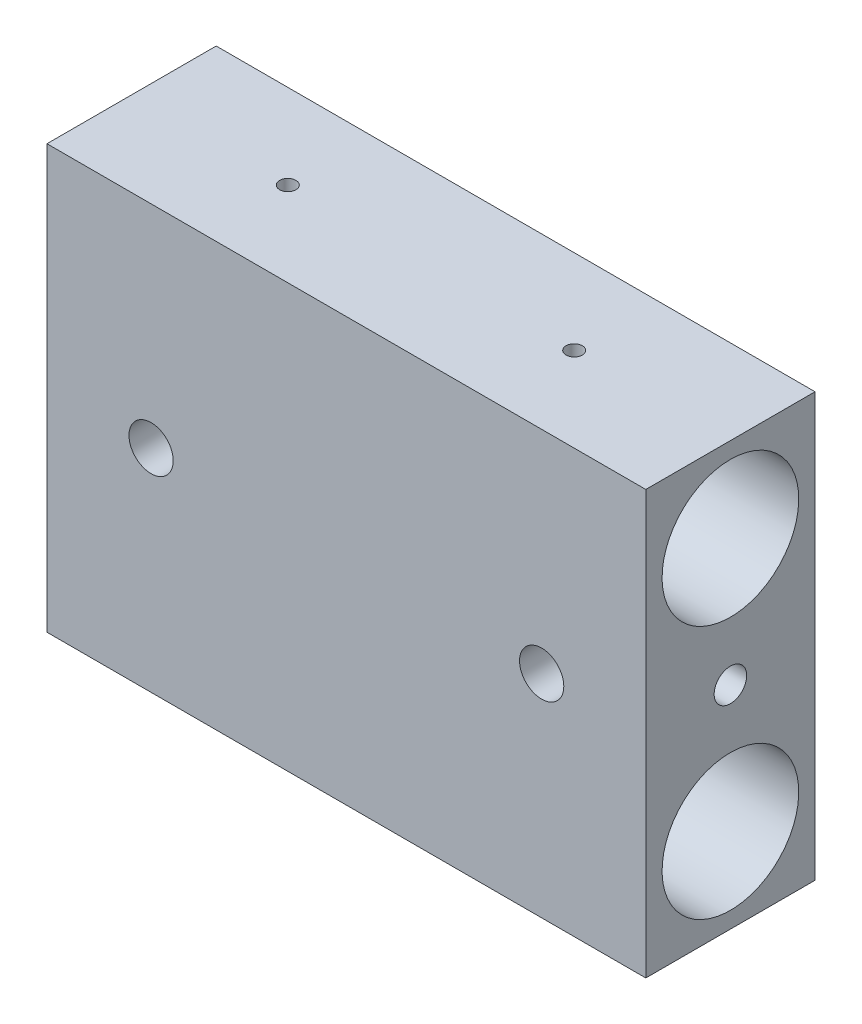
ISO-10303-21;
HEADER;
FILE_DESCRIPTION(('STEP AP214'),'2;1');
FILE_NAME('part.step','',(''),(''),'','','');
FILE_SCHEMA(('AUTOMOTIVE_DESIGN { 1 0 10303 214 1 1 1 1 }'));
ENDSEC;
DATA;
#1=APPLICATION_CONTEXT('core data for automotive mechanical design processes');
#2=APPLICATION_PROTOCOL_DEFINITION('international standard','automotive_design',2000,#1);
#3=PRODUCT_CONTEXT('',#1,'mechanical');
#4=PRODUCT('Part','Part','',(#3));
#5=PRODUCT_RELATED_PRODUCT_CATEGORY('part','',(#4));
#6=PRODUCT_DEFINITION_FORMATION('','',#4);
#7=PRODUCT_DEFINITION_CONTEXT('part definition',#1,'design');
#8=PRODUCT_DEFINITION('design','',#6,#7);
#9=PRODUCT_DEFINITION_SHAPE('','',#8);
#10=(LENGTH_UNIT() NAMED_UNIT(*) SI_UNIT(.MILLI.,.METRE.));
#11=(NAMED_UNIT(*) PLANE_ANGLE_UNIT() SI_UNIT($,.RADIAN.));
#12=(NAMED_UNIT(*) SI_UNIT($,.STERADIAN.) SOLID_ANGLE_UNIT());
#13=UNCERTAINTY_MEASURE_WITH_UNIT(LENGTH_MEASURE(1.E-05),#10,'distance_accuracy_value','');
#14=(GEOMETRIC_REPRESENTATION_CONTEXT(3) GLOBAL_UNCERTAINTY_ASSIGNED_CONTEXT((#13)) GLOBAL_UNIT_ASSIGNED_CONTEXT((#10,
#11,#12)) REPRESENTATION_CONTEXT('',''));
#15=CARTESIAN_POINT('',(0.,0.,0.));
#16=DIRECTION('',(0.,0.,1.));
#17=DIRECTION('',(1.,0.,0.));
#18=AXIS2_PLACEMENT_3D('',#15,#16,#17);
#19=CARTESIAN_POINT('',(46.,0.,13.));
#20=DIRECTION('',(1.,0.,0.));
#21=DIRECTION('',(0.,0.,-1.));
#22=AXIS2_PLACEMENT_3D('',#19,#20,#21);
#23=CYLINDRICAL_SURFACE('',#22,2.5);
#24=CARTESIAN_POINT('',(33.4,0.,10.5));
#25=CARTESIAN_POINT('',(33.3999905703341,-0.122699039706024,10.5000098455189));
#26=CARTESIAN_POINT('',(33.3932901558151,-0.245547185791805,10.5091019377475));
#27=CARTESIAN_POINT('',(33.367098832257,-0.487351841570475,10.5449038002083));
#28=CARTESIAN_POINT('',(33.3475832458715,-0.60630037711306,10.5716475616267));
#29=CARTESIAN_POINT('',(33.2976485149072,-0.836230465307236,10.6409622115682));
#30=CARTESIAN_POINT('',(33.2672922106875,-0.947253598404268,10.6834419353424));
#31=CARTESIAN_POINT('',(33.1979862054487,-1.15991867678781,10.7822637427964));
#32=CARTESIAN_POINT('',(33.1590377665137,-1.26156199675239,10.8386037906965));
#33=CARTESIAN_POINT('',(33.0712057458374,-1.46316877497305,10.9690276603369));
#34=CARTESIAN_POINT('',(33.0217392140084,-1.56212775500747,11.0442632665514));
#35=CARTESIAN_POINT('',(32.9188386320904,-1.74688039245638,11.2073417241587));
#36=CARTESIAN_POINT('',(32.8653985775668,-1.83265349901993,11.2952038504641));
#37=CARTESIAN_POINT('',(32.747648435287,-2.00584095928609,11.5006512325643));
#38=CARTESIAN_POINT('',(32.6832542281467,-2.09030274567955,11.6206899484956));
#39=CARTESIAN_POINT('',(32.5612693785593,-2.23808866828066,11.8763062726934));
#40=CARTESIAN_POINT('',(32.5036688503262,-2.30144376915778,12.011860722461));
#41=CARTESIAN_POINT('',(32.4217782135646,-2.38689321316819,12.249721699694));
#42=CARTESIAN_POINT('',(32.3927911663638,-2.41570036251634,12.3479773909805));
#43=CARTESIAN_POINT('',(32.3458907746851,-2.46127548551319,12.5497038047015));
#44=CARTESIAN_POINT('',(32.3279524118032,-2.47807067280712,12.6531621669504));
#45=CARTESIAN_POINT('',(32.3059849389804,-2.49853711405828,12.8637486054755));
#46=CARTESIAN_POINT('',(32.3020658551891,-2.50210456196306,12.9708990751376));
#47=CARTESIAN_POINT('',(32.3092338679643,-2.49548634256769,13.1842949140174));
#48=CARTESIAN_POINT('',(32.3203309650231,-2.48529150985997,13.2905396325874));
#49=CARTESIAN_POINT('',(32.3573122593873,-2.45025863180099,13.5097571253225));
#50=CARTESIAN_POINT('',(32.3846445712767,-2.42397756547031,13.6222424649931));
#51=CARTESIAN_POINT('',(32.4503540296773,-2.3575272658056,13.8396781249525));
#52=CARTESIAN_POINT('',(32.4887573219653,-2.31732510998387,13.9446098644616));
#53=CARTESIAN_POINT('',(32.5867068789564,-2.20817268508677,14.1817536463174));
#54=CARTESIAN_POINT('',(32.6489263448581,-2.13408361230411,14.3104821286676));
#55=CARTESIAN_POINT('',(32.7763977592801,-1.96541129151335,14.5520589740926));
#56=CARTESIAN_POINT('',(32.8416530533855,-1.87080499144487,14.6648892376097));
#57=CARTESIAN_POINT('',(32.9695012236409,-1.66055304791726,14.8748161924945));
#58=CARTESIAN_POINT('',(33.0320421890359,-1.54462389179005,14.9716627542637));
#59=CARTESIAN_POINT('',(33.1471908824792,-1.29387553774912,15.1445152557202));
#60=CARTESIAN_POINT('',(33.1998181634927,-1.15909445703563,15.220562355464));
#61=CARTESIAN_POINT('',(33.2778714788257,-0.909955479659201,15.3314271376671));
#62=CARTESIAN_POINT('',(33.3068118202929,-0.799164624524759,15.371813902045));
#63=CARTESIAN_POINT('',(33.3537274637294,-0.570951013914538,15.4368016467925));
#64=CARTESIAN_POINT('',(33.3717292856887,-0.453545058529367,15.4614408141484));
#65=CARTESIAN_POINT('',(33.3889718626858,-0.27924146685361,15.4849849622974));
#66=CARTESIAN_POINT('',(33.393096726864,-0.2236381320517,15.4906047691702));
#67=CARTESIAN_POINT('',(33.3986132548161,-0.112033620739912,15.4981149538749));
#68=CARTESIAN_POINT('',(33.4000043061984,-0.0560323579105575,15.5000044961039));
#69=CARTESIAN_POINT('',(33.3999905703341,0.122699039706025,15.4999901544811));
#70=CARTESIAN_POINT('',(33.3932901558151,0.245547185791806,15.4908980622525));
#71=CARTESIAN_POINT('',(33.367098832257,0.487351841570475,15.4550961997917));
#72=CARTESIAN_POINT('',(33.3475832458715,0.606300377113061,15.4283524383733));
#73=CARTESIAN_POINT('',(33.2976485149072,0.836230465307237,15.3590377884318));
#74=CARTESIAN_POINT('',(33.2672922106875,0.947253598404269,15.3165580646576));
#75=CARTESIAN_POINT('',(33.1979862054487,1.15991867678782,15.2177362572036));
#76=CARTESIAN_POINT('',(33.1590377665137,1.26156199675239,15.1613962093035));
#77=CARTESIAN_POINT('',(33.0712057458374,1.46316877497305,15.0309723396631));
#78=CARTESIAN_POINT('',(33.0217392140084,1.56212775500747,14.9557367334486));
#79=CARTESIAN_POINT('',(32.9188386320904,1.74688039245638,14.7926582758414));
#80=CARTESIAN_POINT('',(32.8653985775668,1.83265349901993,14.7047961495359));
#81=CARTESIAN_POINT('',(32.747648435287,2.00584095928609,14.4993487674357));
#82=CARTESIAN_POINT('',(32.6832542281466,2.09030274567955,14.3793100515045));
#83=CARTESIAN_POINT('',(32.5612693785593,2.23808866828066,14.1236937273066));
#84=CARTESIAN_POINT('',(32.5036688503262,2.30144376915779,13.988139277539));
#85=CARTESIAN_POINT('',(32.4217782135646,2.38689321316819,13.750278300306));
#86=CARTESIAN_POINT('',(32.3927911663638,2.41570036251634,13.6520226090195));
#87=CARTESIAN_POINT('',(32.3458907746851,2.46127548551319,13.4502961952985));
#88=CARTESIAN_POINT('',(32.3279524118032,2.47807067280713,13.3468378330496));
#89=CARTESIAN_POINT('',(32.3059849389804,2.49853711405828,13.1362513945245));
#90=CARTESIAN_POINT('',(32.3020658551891,2.50210456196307,13.0291009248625));
#91=CARTESIAN_POINT('',(32.3092338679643,2.4954863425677,12.8157050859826));
#92=CARTESIAN_POINT('',(32.3203309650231,2.48529150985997,12.7094603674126));
#93=CARTESIAN_POINT('',(32.3573122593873,2.450258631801,12.4902428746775));
#94=CARTESIAN_POINT('',(32.3846445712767,2.42397756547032,12.377757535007));
#95=CARTESIAN_POINT('',(32.4503540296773,2.3575272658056,12.1603218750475));
#96=CARTESIAN_POINT('',(32.4887573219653,2.31732510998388,12.0553901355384));
#97=CARTESIAN_POINT('',(32.5867068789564,2.20817268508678,11.8182463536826));
#98=CARTESIAN_POINT('',(32.6489263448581,2.13408361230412,11.6895178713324));
#99=CARTESIAN_POINT('',(32.7763977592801,1.96541129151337,11.4479410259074));
#100=CARTESIAN_POINT('',(32.8416530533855,1.87080499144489,11.3351107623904));
#101=CARTESIAN_POINT('',(32.9695012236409,1.66055304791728,11.1251838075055));
#102=CARTESIAN_POINT('',(33.0320421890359,1.54462389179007,11.0283372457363));
#103=CARTESIAN_POINT('',(33.1471908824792,1.29387553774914,10.8554847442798));
#104=CARTESIAN_POINT('',(33.1998181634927,1.15909445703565,10.779437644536));
#105=CARTESIAN_POINT('',(33.2778714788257,0.909955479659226,10.6685728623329));
#106=CARTESIAN_POINT('',(33.3068118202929,0.799164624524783,10.628186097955));
#107=CARTESIAN_POINT('',(33.3537274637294,0.570951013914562,10.5631983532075));
#108=CARTESIAN_POINT('',(33.3717292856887,0.453545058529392,10.5385591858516));
#109=CARTESIAN_POINT('',(33.3889718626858,0.279241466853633,10.5150150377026));
#110=CARTESIAN_POINT('',(33.393096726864,0.223638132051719,10.5093952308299));
#111=CARTESIAN_POINT('',(33.3986132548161,0.112033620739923,10.5018850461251));
#112=CARTESIAN_POINT('',(33.4000043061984,0.0560323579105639,10.4999955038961));
#113=CARTESIAN_POINT('',(33.4,0.,10.5));
#114=B_SPLINE_CURVE_WITH_KNOTS('',3,(#24,#25,#26,#27,#28,#29,#30,#31,#32,#33,#34,#35,#36,#37,
#38,#39,#40,#41,#42,#43,#44,#45,#46,#47,#48,#49,#50,#51,#52,#53,#54,#55,#56,#57,#58,#59,#60,#61,
#62,#63,#64,#65,#66,#67,#68,#69,#70,#71,#72,#73,#74,#75,#76,#77,#78,#79,#80,#81,#82,#83,#84,#85,
#86,#87,#88,#89,#90,#91,#92,#93,#94,#95,#96,#97,#98,#99,#100,#101,#102,#103,#104,#105,#106,#107,
#108,#109,#110,#111,#112,#113),.UNSPECIFIED.,.T.,.F.,(4,2,2,2,2,2,2,2,2,2,2,2,2,2,2,2,2,2,2,2,2,
2,2,2,2,2,2,2,2,2,2,2,2,2,2,2,2,2,2,2,2,2,2,2,4),(0.,0.367858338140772,0.736427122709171,
1.10289320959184,1.46930550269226,1.86924068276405,2.26979299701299,2.74859250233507,
3.22668645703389,3.5448160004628,3.86222250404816,4.18211467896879,4.50222000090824,
4.8563947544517,5.21141289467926,5.69204068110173,6.17321129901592,6.66131507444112,
7.14844583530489,7.51124929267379,7.87316960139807,8.04112001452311,8.20910804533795,
8.57696638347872,8.94553516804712,9.3120012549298,9.67841354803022,10.078348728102,
10.4789010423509,10.957700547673,11.4357945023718,11.7539240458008,12.0713305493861,
12.3912227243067,12.7113280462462,13.0655027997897,13.4205209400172,13.9011487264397,
14.3823193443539,14.8704231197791,15.3575538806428,15.7203573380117,16.082277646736,
16.2502280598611,16.4182160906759),.UNSPECIFIED.);
#115=CARTESIAN_POINT('',(33.4,0.,10.5));
#116=VERTEX_POINT('',#115);
#117=EDGE_CURVE('E128',#116,#116,#114,.T.);
#118=ORIENTED_EDGE('',*,*,#117,.T.);
#119=EDGE_LOOP('',(#118));
#120=FACE_BOUND('',#119,.T.);
#121=CARTESIAN_POINT('',(46.,0.,13.));
#122=DIRECTION('',(1.,0.,0.));
#123=DIRECTION('',(0.,0.,-1.));
#124=AXIS2_PLACEMENT_3D('',#121,#122,#123);
#125=CIRCLE('',#124,2.5);
#126=CARTESIAN_POINT('',(46.,0.,10.5));
#127=VERTEX_POINT('',#126);
#128=EDGE_CURVE('E122',#127,#127,#125,.T.);
#129=ORIENTED_EDGE('',*,*,#128,.T.);
#130=EDGE_LOOP('',(#129));
#131=FACE_BOUND('',#130,.T.);
#132=ADVANCED_FACE('F17',(#120,#131),#23,.F.);
#133=CARTESIAN_POINT('',(-22.,32.5,13.));
#134=DIRECTION('',(0.,1.,0.));
#135=DIRECTION('',(0.,0.,1.));
#136=AXIS2_PLACEMENT_3D('',#133,#134,#135);
#137=CYLINDRICAL_SURFACE('',#136,1.25);
#138=CARTESIAN_POINT('',(-20.75,30.,13.));
#139=CARTESIAN_POINT('',(-20.750003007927,29.9999990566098,13.0699466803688));
#140=CARTESIAN_POINT('',(-20.7558908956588,29.9992936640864,13.1399383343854));
#141=CARTESIAN_POINT('',(-20.7792871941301,29.996547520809,13.2779766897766));
#142=CARTESIAN_POINT('',(-20.7968080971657,29.9945053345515,13.3460212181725));
#143=CARTESIAN_POINT('',(-20.8429488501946,29.9893157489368,13.4781466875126));
#144=CARTESIAN_POINT('',(-20.8715615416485,29.9861690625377,13.5422301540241));
#145=CARTESIAN_POINT('',(-20.9390570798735,29.9791210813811,13.6646704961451));
#146=CARTESIAN_POINT('',(-20.9779377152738,29.9752199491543,13.7230286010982));
#147=CARTESIAN_POINT('',(-21.0650699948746,29.9670774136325,13.8326645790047));
#148=CARTESIAN_POINT('',(-21.1133619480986,29.9628345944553,13.8839103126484));
#149=CARTESIAN_POINT('',(-21.2178740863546,29.9544972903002,13.9776016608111));
#150=CARTESIAN_POINT('',(-21.2740964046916,29.9504028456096,14.0200448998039));
#151=CARTESIAN_POINT('',(-21.3930940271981,29.9428109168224,14.0950481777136));
#152=CARTESIAN_POINT('',(-21.4558914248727,29.939315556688,14.1275733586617));
#153=CARTESIAN_POINT('',(-21.5860614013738,29.9333425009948,14.1815705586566));
#154=CARTESIAN_POINT('',(-21.653428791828,29.9308636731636,14.2030548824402));
#155=CARTESIAN_POINT('',(-21.7676358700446,29.9278190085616,14.2291028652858));
#156=CARTESIAN_POINT('',(-21.8137483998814,29.926890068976,14.2369282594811));
#157=CARTESIAN_POINT('',(-21.9065672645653,29.9256451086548,14.2473778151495));
#158=CARTESIAN_POINT('',(-21.9532735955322,29.925329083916,14.2500020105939));
#159=CARTESIAN_POINT('',(-22.0699447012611,29.9253306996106,14.2499969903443));
#160=CARTESIAN_POINT('',(-22.1399343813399,29.9260412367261,14.2441094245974));
#161=CARTESIAN_POINT('',(-22.2779686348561,29.9288057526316,14.2207145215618));
#162=CARTESIAN_POINT('',(-22.3460110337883,29.9308611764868,14.2031946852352));
#163=CARTESIAN_POINT('',(-22.4781320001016,29.9360794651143,14.1570570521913));
#164=CARTESIAN_POINT('',(-22.5422131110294,29.9392416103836,14.12844646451));
#165=CARTESIAN_POINT('',(-22.6646495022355,29.9463160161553,14.060955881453));
#166=CARTESIAN_POINT('',(-22.7230060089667,29.9502281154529,14.0220780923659));
#167=CARTESIAN_POINT('',(-22.832643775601,29.9583836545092,13.9349486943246));
#168=CARTESIAN_POINT('',(-22.883892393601,29.9626284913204,13.8866561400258));
#169=CARTESIAN_POINT('',(-22.9775893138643,29.9709596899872,13.7821415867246));
#170=CARTESIAN_POINT('',(-23.0200352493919,29.9750460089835,13.7259174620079));
#171=CARTESIAN_POINT('',(-23.0950413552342,29.9826148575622,13.6069182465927));
#172=CARTESIAN_POINT('',(-23.1275671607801,29.9860952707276,13.5441213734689));
#173=CARTESIAN_POINT('',(-23.1815656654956,29.9920384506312,13.4139525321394));
#174=CARTESIAN_POINT('',(-23.2030506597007,29.9945023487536,13.34658574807));
#175=CARTESIAN_POINT('',(-23.2291005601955,29.9975277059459,13.2323768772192));
#176=CARTESIAN_POINT('',(-23.2369268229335,29.9984503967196,13.186261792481));
#177=CARTESIAN_POINT('',(-23.2473775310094,29.9996868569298,13.0934378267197));
#178=CARTESIAN_POINT('',(-23.2500020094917,30.0000006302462,13.046728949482));
#179=CARTESIAN_POINT('',(-23.249996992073,29.9999990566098,12.9300533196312));
#180=CARTESIAN_POINT('',(-23.2441091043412,29.9992936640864,12.8600616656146));
#181=CARTESIAN_POINT('',(-23.2207128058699,29.996547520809,12.7220233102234));
#182=CARTESIAN_POINT('',(-23.2031919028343,29.9945053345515,12.6539787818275));
#183=CARTESIAN_POINT('',(-23.1570511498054,29.9893157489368,12.5218533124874));
#184=CARTESIAN_POINT('',(-23.1284384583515,29.9861690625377,12.4577698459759));
#185=CARTESIAN_POINT('',(-23.0609429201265,29.9791210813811,12.3353295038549));
#186=CARTESIAN_POINT('',(-23.0220622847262,29.9752199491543,12.2769713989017));
#187=CARTESIAN_POINT('',(-22.9349300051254,29.9670774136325,12.1673354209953));
#188=CARTESIAN_POINT('',(-22.8866380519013,29.9628345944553,12.1160896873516));
#189=CARTESIAN_POINT('',(-22.7821259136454,29.9544972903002,12.0223983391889));
#190=CARTESIAN_POINT('',(-22.7259035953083,29.9504028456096,11.9799551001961));
#191=CARTESIAN_POINT('',(-22.6069059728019,29.9428109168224,11.9049518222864));
#192=CARTESIAN_POINT('',(-22.5441085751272,29.939315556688,11.8724266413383));
#193=CARTESIAN_POINT('',(-22.4139385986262,29.9333425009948,11.8184294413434));
#194=CARTESIAN_POINT('',(-22.346571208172,29.9308636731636,11.7969451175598));
#195=CARTESIAN_POINT('',(-22.2323641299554,29.9278190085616,11.7708971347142));
#196=CARTESIAN_POINT('',(-22.1862516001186,29.926890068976,11.7630717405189));
#197=CARTESIAN_POINT('',(-22.0934327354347,29.9256451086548,11.7526221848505));
#198=CARTESIAN_POINT('',(-22.0467264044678,29.925329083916,11.7499979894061));
#199=CARTESIAN_POINT('',(-21.9300552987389,29.9253306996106,11.7500030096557));
#200=CARTESIAN_POINT('',(-21.8600656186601,29.9260412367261,11.7558905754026));
#201=CARTESIAN_POINT('',(-21.7220313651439,29.9288057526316,11.7792854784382));
#202=CARTESIAN_POINT('',(-21.6539889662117,29.9308611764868,11.7968053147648));
#203=CARTESIAN_POINT('',(-21.5218679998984,29.9360794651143,11.8429429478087));
#204=CARTESIAN_POINT('',(-21.4577868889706,29.9392416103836,11.87155353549));
#205=CARTESIAN_POINT('',(-21.3353504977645,29.9463160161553,11.939044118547));
#206=CARTESIAN_POINT('',(-21.2769939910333,29.9502281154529,11.9779219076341));
#207=CARTESIAN_POINT('',(-21.167356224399,29.9583836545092,12.0650513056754));
#208=CARTESIAN_POINT('',(-21.116107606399,29.9626284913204,12.1133438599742));
#209=CARTESIAN_POINT('',(-21.0224106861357,29.9709596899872,12.2178584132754));
#210=CARTESIAN_POINT('',(-20.9799647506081,29.9750460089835,12.2740825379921));
#211=CARTESIAN_POINT('',(-20.9049586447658,29.9826148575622,12.3930817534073));
#212=CARTESIAN_POINT('',(-20.8724328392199,29.9860952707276,12.4558786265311));
#213=CARTESIAN_POINT('',(-20.8184343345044,29.9920384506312,12.5860474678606));
#214=CARTESIAN_POINT('',(-20.7969493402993,29.9945023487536,12.65341425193));
#215=CARTESIAN_POINT('',(-20.7708994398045,29.9975277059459,12.7676231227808));
#216=CARTESIAN_POINT('',(-20.7630731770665,29.9984503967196,12.813738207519));
#217=CARTESIAN_POINT('',(-20.7526224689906,29.9996868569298,12.9065621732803));
#218=CARTESIAN_POINT('',(-20.7499979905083,30.0000006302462,12.953271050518));
#219=CARTESIAN_POINT('',(-20.75,30.,13.));
#220=B_SPLINE_CURVE_WITH_KNOTS('',3,(#138,#139,#140,#141,#142,#143,#144,#145,#146,#147,#148,
#149,#150,#151,#152,#153,#154,#155,#156,#157,#158,#159,#160,#161,#162,#163,#164,#165,#166,#167,
#168,#169,#170,#171,#172,#173,#174,#175,#176,#177,#178,#179,#180,#181,#182,#183,#184,#185,#186,
#187,#188,#189,#190,#191,#192,#193,#194,#195,#196,#197,#198,#199,#200,#201,#202,#203,#204,#205,
#206,#207,#208,#209,#210,#211,#212,#213,#214,#215,#216,#217,#218,#219),.UNSPECIFIED.,.T.,.F.,(4,
2,2,2,2,2,2,2,2,2,2,2,2,2,2,2,2,2,2,2,2,2,2,2,2,2,2,2,2,2,2,2,2,2,2,2,2,2,2,2,4),(0.,
0.20966929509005,0.419564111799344,0.629323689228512,0.839038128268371,1.04967134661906,
1.26036133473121,1.47178349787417,1.68296952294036,1.82303557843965,1.96310071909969,
2.17276406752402,2.38265306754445,2.59240586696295,2.80211362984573,3.01275463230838,
3.22345219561,3.43487156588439,3.6460549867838,3.78612865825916,3.92620143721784,
4.13587073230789,4.34576554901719,4.55552512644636,4.76523956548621,4.9758727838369,
5.18656277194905,5.39798493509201,5.6091709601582,5.74923701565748,5.88930215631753,
6.09896550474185,6.30885450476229,6.51860730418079,6.72831506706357,6.93895606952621,
7.14965363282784,7.36107300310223,7.57225642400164,7.712330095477,7.85240287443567),.UNSPECIFIED.);
#221=CARTESIAN_POINT('',(-20.75,30.,13.));
#222=VERTEX_POINT('',#221);
#223=EDGE_CURVE('E180',#222,#222,#220,.T.);
#224=ORIENTED_EDGE('',*,*,#223,.T.);
#225=EDGE_LOOP('',(#224));
#226=FACE_BOUND('',#225,.T.);
#227=CARTESIAN_POINT('',(-22.,32.5,13.));
#228=DIRECTION('',(0.,1.,0.));
#229=DIRECTION('',(0.,0.,1.));
#230=AXIS2_PLACEMENT_3D('',#227,#228,#229);
#231=CIRCLE('',#230,1.25);
#232=CARTESIAN_POINT('',(-22.,32.5,14.25));
#233=VERTEX_POINT('',#232);
#234=EDGE_CURVE('E75',#233,#233,#231,.T.);
#235=ORIENTED_EDGE('',*,*,#234,.T.);
#236=EDGE_LOOP('',(#235));
#237=FACE_BOUND('',#236,.T.);
#238=ADVANCED_FACE('F175',(#226,#237),#137,.F.);
#239=CARTESIAN_POINT('',(22.,32.5,13.));
#240=DIRECTION('',(0.,1.,0.));
#241=DIRECTION('',(0.,0.,1.));
#242=AXIS2_PLACEMENT_3D('',#239,#240,#241);
#243=CYLINDRICAL_SURFACE('',#242,1.25);
#244=CARTESIAN_POINT('',(23.25,30.,13.));
#245=CARTESIAN_POINT('',(23.249996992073,29.9999990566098,13.0699466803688));
#246=CARTESIAN_POINT('',(23.2441091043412,29.9992936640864,13.1399383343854));
#247=CARTESIAN_POINT('',(23.2207128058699,29.996547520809,13.2779766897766));
#248=CARTESIAN_POINT('',(23.2031919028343,29.9945053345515,13.3460212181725));
#249=CARTESIAN_POINT('',(23.1570511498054,29.9893157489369,13.4781466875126));
#250=CARTESIAN_POINT('',(23.1284384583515,29.9861690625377,13.5422301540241));
#251=CARTESIAN_POINT('',(23.0609429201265,29.9791210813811,13.6646704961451));
#252=CARTESIAN_POINT('',(23.0220622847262,29.9752199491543,13.7230286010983));
#253=CARTESIAN_POINT('',(22.9349300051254,29.9670774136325,13.8326645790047));
#254=CARTESIAN_POINT('',(22.8866380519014,29.9628345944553,13.8839103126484));
#255=CARTESIAN_POINT('',(22.7821259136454,29.9544972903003,13.9776016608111));
#256=CARTESIAN_POINT('',(22.7259035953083,29.9504028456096,14.0200448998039));
#257=CARTESIAN_POINT('',(22.6069059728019,29.9428109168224,14.0950481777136));
#258=CARTESIAN_POINT('',(22.5441085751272,29.939315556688,14.1275733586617));
#259=CARTESIAN_POINT('',(22.4139385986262,29.9333425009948,14.1815705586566));
#260=CARTESIAN_POINT('',(22.346571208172,29.9308636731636,14.2030548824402));
#261=CARTESIAN_POINT('',(22.2323641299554,29.9278190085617,14.2291028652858));
#262=CARTESIAN_POINT('',(22.1862516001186,29.926890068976,14.2369282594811));
#263=CARTESIAN_POINT('',(22.0934327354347,29.9256451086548,14.2473778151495));
#264=CARTESIAN_POINT('',(22.0467264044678,29.925329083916,14.2500020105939));
#265=CARTESIAN_POINT('',(21.9300552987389,29.9253306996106,14.2499969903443));
#266=CARTESIAN_POINT('',(21.8600656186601,29.9260412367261,14.2441094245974));
#267=CARTESIAN_POINT('',(21.7220313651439,29.9288057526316,14.2207145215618));
#268=CARTESIAN_POINT('',(21.6539889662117,29.9308611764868,14.2031946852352));
#269=CARTESIAN_POINT('',(21.5218679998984,29.9360794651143,14.1570570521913));
#270=CARTESIAN_POINT('',(21.4577868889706,29.9392416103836,14.12844646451));
#271=CARTESIAN_POINT('',(21.3353504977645,29.9463160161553,14.060955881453));
#272=CARTESIAN_POINT('',(21.2769939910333,29.9502281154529,14.0220780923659));
#273=CARTESIAN_POINT('',(21.167356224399,29.9583836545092,13.9349486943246));
#274=CARTESIAN_POINT('',(21.116107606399,29.9626284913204,13.8866561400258));
#275=CARTESIAN_POINT('',(21.0224106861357,29.9709596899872,13.7821415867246));
#276=CARTESIAN_POINT('',(20.9799647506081,29.9750460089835,13.7259174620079));
#277=CARTESIAN_POINT('',(20.9049586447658,29.9826148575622,13.6069182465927));
#278=CARTESIAN_POINT('',(20.8724328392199,29.9860952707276,13.5441213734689));
#279=CARTESIAN_POINT('',(20.8184343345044,29.9920384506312,13.4139525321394));
#280=CARTESIAN_POINT('',(20.7969493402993,29.9945023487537,13.34658574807));
#281=CARTESIAN_POINT('',(20.7708994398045,29.9975277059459,13.2323768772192));
#282=CARTESIAN_POINT('',(20.7630731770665,29.9984503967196,13.186261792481));
#283=CARTESIAN_POINT('',(20.7526224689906,29.9996868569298,13.0934378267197));
#284=CARTESIAN_POINT('',(20.7499979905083,30.0000006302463,13.046728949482));
#285=CARTESIAN_POINT('',(20.750003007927,29.9999990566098,12.9300533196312));
#286=CARTESIAN_POINT('',(20.7558908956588,29.9992936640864,12.8600616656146));
#287=CARTESIAN_POINT('',(20.7792871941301,29.996547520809,12.7220233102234));
#288=CARTESIAN_POINT('',(20.7968080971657,29.9945053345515,12.6539787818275));
#289=CARTESIAN_POINT('',(20.8429488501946,29.9893157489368,12.5218533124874));
#290=CARTESIAN_POINT('',(20.8715615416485,29.9861690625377,12.4577698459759));
#291=CARTESIAN_POINT('',(20.9390570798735,29.9791210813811,12.3353295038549));
#292=CARTESIAN_POINT('',(20.9779377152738,29.9752199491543,12.2769713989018));
#293=CARTESIAN_POINT('',(21.0650699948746,29.9670774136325,12.1673354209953));
#294=CARTESIAN_POINT('',(21.1133619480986,29.9628345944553,12.1160896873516));
#295=CARTESIAN_POINT('',(21.2178740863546,29.9544972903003,12.0223983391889));
#296=CARTESIAN_POINT('',(21.2740964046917,29.9504028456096,11.9799551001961));
#297=CARTESIAN_POINT('',(21.3930940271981,29.9428109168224,11.9049518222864));
#298=CARTESIAN_POINT('',(21.4558914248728,29.939315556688,11.8724266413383));
#299=CARTESIAN_POINT('',(21.5860614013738,29.9333425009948,11.8184294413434));
#300=CARTESIAN_POINT('',(21.653428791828,29.9308636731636,11.7969451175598));
#301=CARTESIAN_POINT('',(21.7676358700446,29.9278190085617,11.7708971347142));
#302=CARTESIAN_POINT('',(21.8137483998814,29.926890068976,11.7630717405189));
#303=CARTESIAN_POINT('',(21.9065672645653,29.9256451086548,11.7526221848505));
#304=CARTESIAN_POINT('',(21.9532735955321,29.925329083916,11.7499979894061));
#305=CARTESIAN_POINT('',(22.0699447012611,29.9253306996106,11.7500030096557));
#306=CARTESIAN_POINT('',(22.1399343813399,29.9260412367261,11.7558905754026));
#307=CARTESIAN_POINT('',(22.2779686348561,29.9288057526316,11.7792854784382));
#308=CARTESIAN_POINT('',(22.3460110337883,29.9308611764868,11.7968053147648));
#309=CARTESIAN_POINT('',(22.4781320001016,29.9360794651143,11.8429429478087));
#310=CARTESIAN_POINT('',(22.5422131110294,29.9392416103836,11.87155353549));
#311=CARTESIAN_POINT('',(22.6646495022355,29.9463160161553,11.939044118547));
#312=CARTESIAN_POINT('',(22.7230060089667,29.9502281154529,11.977921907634));
#313=CARTESIAN_POINT('',(22.832643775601,29.9583836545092,12.0650513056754));
#314=CARTESIAN_POINT('',(22.883892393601,29.9626284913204,12.1133438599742));
#315=CARTESIAN_POINT('',(22.9775893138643,29.9709596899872,12.2178584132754));
#316=CARTESIAN_POINT('',(23.0200352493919,29.9750460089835,12.2740825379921));
#317=CARTESIAN_POINT('',(23.0950413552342,29.9826148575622,12.3930817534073));
#318=CARTESIAN_POINT('',(23.1275671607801,29.9860952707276,12.4558786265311));
#319=CARTESIAN_POINT('',(23.1815656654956,29.9920384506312,12.5860474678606));
#320=CARTESIAN_POINT('',(23.2030506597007,29.9945023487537,12.65341425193));
#321=CARTESIAN_POINT('',(23.2291005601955,29.9975277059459,12.7676231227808));
#322=CARTESIAN_POINT('',(23.2369268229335,29.9984503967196,12.813738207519));
#323=CARTESIAN_POINT('',(23.2473775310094,29.9996868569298,12.9065621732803));
#324=CARTESIAN_POINT('',(23.2500020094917,30.0000006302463,12.953271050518));
#325=CARTESIAN_POINT('',(23.25,30.,13.));
#326=B_SPLINE_CURVE_WITH_KNOTS('',3,(#244,#245,#246,#247,#248,#249,#250,#251,#252,#253,#254,
#255,#256,#257,#258,#259,#260,#261,#262,#263,#264,#265,#266,#267,#268,#269,#270,#271,#272,#273,
#274,#275,#276,#277,#278,#279,#280,#281,#282,#283,#284,#285,#286,#287,#288,#289,#290,#291,#292,
#293,#294,#295,#296,#297,#298,#299,#300,#301,#302,#303,#304,#305,#306,#307,#308,#309,#310,#311,
#312,#313,#314,#315,#316,#317,#318,#319,#320,#321,#322,#323,#324,#325),.UNSPECIFIED.,.T.,.F.,(4,
2,2,2,2,2,2,2,2,2,2,2,2,2,2,2,2,2,2,2,2,2,2,2,2,2,2,2,2,2,2,2,2,2,2,2,2,2,2,2,4),(0.,
0.209669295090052,0.419564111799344,0.629323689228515,0.839038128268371,1.04967134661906,
1.26036133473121,1.47178349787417,1.68296952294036,1.82303557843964,1.9631007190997,
2.17276406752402,2.38265306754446,2.59240586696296,2.80211362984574,3.01275463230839,
3.22345219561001,3.4348715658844,3.64605498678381,3.78612865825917,3.92620143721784,
4.13587073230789,4.34576554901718,4.55552512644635,4.76523956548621,4.9758727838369,
5.18656277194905,5.39798493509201,5.6091709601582,5.74923701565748,5.88930215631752,
6.09896550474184,6.30885450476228,6.51860730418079,6.72831506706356,6.93895606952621,
7.14965363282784,7.36107300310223,7.57225642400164,7.712330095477,7.85240287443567),.UNSPECIFIED.);
#327=CARTESIAN_POINT('',(23.25,30.,13.));
#328=VERTEX_POINT('',#327);
#329=EDGE_CURVE('E21',#328,#328,#326,.T.);
#330=ORIENTED_EDGE('',*,*,#329,.T.);
#331=EDGE_LOOP('',(#330));
#332=FACE_BOUND('',#331,.T.);
#333=CARTESIAN_POINT('',(22.,32.5,13.));
#334=DIRECTION('',(0.,1.,0.));
#335=DIRECTION('',(0.,0.,1.));
#336=AXIS2_PLACEMENT_3D('',#333,#334,#335);
#337=CIRCLE('',#336,1.25);
#338=CARTESIAN_POINT('',(22.,32.5,14.25));
#339=VERTEX_POINT('',#338);
#340=EDGE_CURVE('E89',#339,#339,#337,.T.);
#341=ORIENTED_EDGE('',*,*,#340,.T.);
#342=EDGE_LOOP('',(#341));
#343=FACE_BOUND('',#342,.T.);
#344=ADVANCED_FACE('F169',(#332,#343),#243,.F.);
#345=CARTESIAN_POINT('',(-46.,-19.5,13.));
#346=DIRECTION('',(1.,0.,0.));
#347=DIRECTION('',(0.,1.,0.));
#348=AXIS2_PLACEMENT_3D('',#345,#346,#347);
#349=CYLINDRICAL_SURFACE('',#348,10.5);
#350=CARTESIAN_POINT('',(22.,-29.9253297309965,11.75));
#351=CARTESIAN_POINT('',(22.0699447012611,-29.9253306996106,11.7500030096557));
#352=CARTESIAN_POINT('',(22.1399343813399,-29.9260412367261,11.7558905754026));
#353=CARTESIAN_POINT('',(22.2779686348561,-29.9288057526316,11.7792854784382));
#354=CARTESIAN_POINT('',(22.3460110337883,-29.9308611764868,11.7968053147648));
#355=CARTESIAN_POINT('',(22.4781320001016,-29.9360794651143,11.8429429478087));
#356=CARTESIAN_POINT('',(22.5422131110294,-29.9392416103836,11.87155353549));
#357=CARTESIAN_POINT('',(22.6646495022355,-29.9463160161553,11.939044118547));
#358=CARTESIAN_POINT('',(22.7230060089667,-29.9502281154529,11.9779219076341));
#359=CARTESIAN_POINT('',(22.832643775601,-29.9583836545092,12.0650513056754));
#360=CARTESIAN_POINT('',(22.883892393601,-29.9626284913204,12.1133438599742));
#361=CARTESIAN_POINT('',(22.9775893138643,-29.9709596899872,12.2178584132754));
#362=CARTESIAN_POINT('',(23.0200352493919,-29.9750460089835,12.2740825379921));
#363=CARTESIAN_POINT('',(23.0950413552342,-29.9826148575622,12.3930817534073));
#364=CARTESIAN_POINT('',(23.1275671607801,-29.9860952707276,12.4558786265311));
#365=CARTESIAN_POINT('',(23.1815656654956,-29.9920384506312,12.5860474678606));
#366=CARTESIAN_POINT('',(23.2030506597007,-29.9945023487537,12.65341425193));
#367=CARTESIAN_POINT('',(23.2291005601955,-29.9975277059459,12.7676231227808));
#368=CARTESIAN_POINT('',(23.2369268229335,-29.9984503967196,12.813738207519));
#369=CARTESIAN_POINT('',(23.2473775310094,-29.9996868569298,12.9065621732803));
#370=CARTESIAN_POINT('',(23.2500020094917,-30.0000006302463,12.953271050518));
#371=CARTESIAN_POINT('',(23.249996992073,-29.9999990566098,13.0699466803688));
#372=CARTESIAN_POINT('',(23.2441091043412,-29.9992936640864,13.1399383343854));
#373=CARTESIAN_POINT('',(23.2207128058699,-29.996547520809,13.2779766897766));
#374=CARTESIAN_POINT('',(23.2031919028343,-29.9945053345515,13.3460212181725));
#375=CARTESIAN_POINT('',(23.1570511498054,-29.9893157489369,13.4781466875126));
#376=CARTESIAN_POINT('',(23.1284384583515,-29.9861690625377,13.5422301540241));
#377=CARTESIAN_POINT('',(23.0609429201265,-29.9791210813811,13.6646704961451));
#378=CARTESIAN_POINT('',(23.0220622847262,-29.9752199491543,13.7230286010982));
#379=CARTESIAN_POINT('',(22.9349300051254,-29.9670774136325,13.8326645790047));
#380=CARTESIAN_POINT('',(22.8866380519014,-29.9628345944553,13.8839103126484));
#381=CARTESIAN_POINT('',(22.7821259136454,-29.9544972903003,13.9776016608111));
#382=CARTESIAN_POINT('',(22.7259035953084,-29.9504028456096,14.0200448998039));
#383=CARTESIAN_POINT('',(22.6069059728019,-29.9428109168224,14.0950481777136));
#384=CARTESIAN_POINT('',(22.5441085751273,-29.939315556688,14.1275733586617));
#385=CARTESIAN_POINT('',(22.4139385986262,-29.9333425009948,14.1815705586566));
#386=CARTESIAN_POINT('',(22.346571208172,-29.9308636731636,14.2030548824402));
#387=CARTESIAN_POINT('',(22.2323641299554,-29.9278190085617,14.2291028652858));
#388=CARTESIAN_POINT('',(22.1862516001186,-29.926890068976,14.2369282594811));
#389=CARTESIAN_POINT('',(22.0934327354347,-29.9256451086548,14.2473778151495));
#390=CARTESIAN_POINT('',(22.0467264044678,-29.925329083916,14.2500020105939));
#391=CARTESIAN_POINT('',(21.9300552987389,-29.9253306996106,14.2499969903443));
#392=CARTESIAN_POINT('',(21.8600656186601,-29.9260412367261,14.2441094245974));
#393=CARTESIAN_POINT('',(21.7220313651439,-29.9288057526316,14.2207145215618));
#394=CARTESIAN_POINT('',(21.6539889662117,-29.9308611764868,14.2031946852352));
#395=CARTESIAN_POINT('',(21.5218679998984,-29.9360794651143,14.1570570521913));
#396=CARTESIAN_POINT('',(21.4577868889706,-29.9392416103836,14.12844646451));
#397=CARTESIAN_POINT('',(21.3353504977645,-29.9463160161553,14.060955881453));
#398=CARTESIAN_POINT('',(21.2769939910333,-29.9502281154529,14.0220780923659));
#399=CARTESIAN_POINT('',(21.167356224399,-29.9583836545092,13.9349486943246));
#400=CARTESIAN_POINT('',(21.116107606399,-29.9626284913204,13.8866561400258));
#401=CARTESIAN_POINT('',(21.0224106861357,-29.9709596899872,13.7821415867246));
#402=CARTESIAN_POINT('',(20.9799647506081,-29.9750460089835,13.7259174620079));
#403=CARTESIAN_POINT('',(20.9049586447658,-29.9826148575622,13.6069182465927));
#404=CARTESIAN_POINT('',(20.8724328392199,-29.9860952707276,13.5441213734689));
#405=CARTESIAN_POINT('',(20.8184343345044,-29.9920384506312,13.4139525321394));
#406=CARTESIAN_POINT('',(20.7969493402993,-29.9945023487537,13.34658574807));
#407=CARTESIAN_POINT('',(20.7708994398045,-29.9975277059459,13.2323768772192));
#408=CARTESIAN_POINT('',(20.7630731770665,-29.9984503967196,13.186261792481));
#409=CARTESIAN_POINT('',(20.7526224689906,-29.9996868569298,13.0934378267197));
#410=CARTESIAN_POINT('',(20.7499979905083,-30.0000006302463,13.046728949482));
#411=CARTESIAN_POINT('',(20.750003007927,-29.9999990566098,12.9300533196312));
#412=CARTESIAN_POINT('',(20.7558908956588,-29.9992936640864,12.8600616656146));
#413=CARTESIAN_POINT('',(20.7792871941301,-29.996547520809,12.7220233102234));
#414=CARTESIAN_POINT('',(20.7968080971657,-29.9945053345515,12.6539787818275));
#415=CARTESIAN_POINT('',(20.8429488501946,-29.9893157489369,12.5218533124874));
#416=CARTESIAN_POINT('',(20.8715615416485,-29.9861690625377,12.4577698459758));
#417=CARTESIAN_POINT('',(20.9390570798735,-29.9791210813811,12.3353295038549));
#418=CARTESIAN_POINT('',(20.9779377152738,-29.9752199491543,12.2769713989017));
#419=CARTESIAN_POINT('',(21.0650699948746,-29.9670774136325,12.1673354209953));
#420=CARTESIAN_POINT('',(21.1133619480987,-29.9628345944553,12.1160896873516));
#421=CARTESIAN_POINT('',(21.2178740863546,-29.9544972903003,12.0223983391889));
#422=CARTESIAN_POINT('',(21.2740964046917,-29.9504028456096,11.9799551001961));
#423=CARTESIAN_POINT('',(21.3930940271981,-29.9428109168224,11.9049518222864));
#424=CARTESIAN_POINT('',(21.4558914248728,-29.939315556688,11.8724266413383));
#425=CARTESIAN_POINT('',(21.5860614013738,-29.9333425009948,11.8184294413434));
#426=CARTESIAN_POINT('',(21.653428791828,-29.9308636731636,11.7969451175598));
#427=CARTESIAN_POINT('',(21.7676358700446,-29.9278190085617,11.7708971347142));
#428=CARTESIAN_POINT('',(21.8137483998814,-29.926890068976,11.7630717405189));
#429=CARTESIAN_POINT('',(21.9065672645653,-29.9256451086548,11.7526221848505));
#430=CARTESIAN_POINT('',(21.9532735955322,-29.925329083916,11.7499979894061));
#431=CARTESIAN_POINT('',(22.,-29.9253297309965,11.75));
#432=B_SPLINE_CURVE_WITH_KNOTS('',3,(#350,#351,#352,#353,#354,#355,#356,#357,#358,#359,#360,
#361,#362,#363,#364,#365,#366,#367,#368,#369,#370,#371,#372,#373,#374,#375,#376,#377,#378,#379,
#380,#381,#382,#383,#384,#385,#386,#387,#388,#389,#390,#391,#392,#393,#394,#395,#396,#397,#398,
#399,#400,#401,#402,#403,#404,#405,#406,#407,#408,#409,#410,#411,#412,#413,#414,#415,#416,#417,
#418,#419,#420,#421,#422,#423,#424,#425,#426,#427,#428,#429,#430,#431),.UNSPECIFIED.,.T.,.F.,(4,
2,2,2,2,2,2,2,2,2,2,2,2,2,2,2,2,2,2,2,2,2,2,2,2,2,2,2,2,2,2,2,2,2,2,2,2,2,2,2,4),(0.,
0.209663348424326,0.419552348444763,0.629305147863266,0.839012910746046,1.04965391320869,
1.26035147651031,1.47177084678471,1.68295426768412,1.82302793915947,1.96310071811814,
2.17277001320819,2.38266482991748,2.59242440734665,2.80213884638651,3.01277206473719,
3.22346205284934,3.4348842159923,3.64607024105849,3.78613629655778,3.92620143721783,
4.13586478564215,4.34575378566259,4.55550658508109,4.76521434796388,4.97585535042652,
5.18655291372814,5.39797228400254,5.60915570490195,5.74922937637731,5.88930215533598,
6.09897145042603,6.30886626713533,6.5186258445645,6.72834028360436,6.93897350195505,
7.1496634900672,7.36108565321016,7.57227167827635,7.71233773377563,7.85240287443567),.UNSPECIFIED.);
#433=CARTESIAN_POINT('',(22.,-29.9253297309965,11.75));
#434=VERTEX_POINT('',#433);
#435=EDGE_CURVE('E156',#434,#434,#432,.T.);
#436=ORIENTED_EDGE('',*,*,#435,.T.);
#437=EDGE_LOOP('',(#436));
#438=FACE_BOUND('',#437,.T.);
#439=CARTESIAN_POINT('',(46.,-19.5,13.));
#440=DIRECTION('',(1.,0.,0.));
#441=DIRECTION('',(0.,1.,0.));
#442=AXIS2_PLACEMENT_3D('',#439,#440,#441);
#443=CIRCLE('',#442,10.5);
#444=CARTESIAN_POINT('',(46.,-9.,13.));
#445=VERTEX_POINT('',#444);
#446=EDGE_CURVE('E119',#445,#445,#443,.T.);
#447=ORIENTED_EDGE('',*,*,#446,.T.);
#448=EDGE_LOOP('',(#447));
#449=FACE_BOUND('',#448,.T.);
#450=CARTESIAN_POINT('',(-46.,-19.5,13.));
#451=DIRECTION('',(1.,0.,0.));
#452=DIRECTION('',(0.,1.,0.));
#453=AXIS2_PLACEMENT_3D('',#450,#451,#452);
#454=CIRCLE('',#453,10.5);
#455=CARTESIAN_POINT('',(-46.,-9.00000000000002,13.));
#456=VERTEX_POINT('',#455);
#457=EDGE_CURVE('E82',#456,#456,#454,.F.);
#458=ORIENTED_EDGE('',*,*,#457,.T.);
#459=EDGE_LOOP('',(#458));
#460=FACE_BOUND('',#459,.T.);
#461=CARTESIAN_POINT('',(-22.,-29.9253297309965,11.75));
#462=CARTESIAN_POINT('',(-21.9300552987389,-29.9253306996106,11.7500030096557));
#463=CARTESIAN_POINT('',(-21.8600656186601,-29.9260412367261,11.7558905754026));
#464=CARTESIAN_POINT('',(-21.7220313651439,-29.9288057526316,11.7792854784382));
#465=CARTESIAN_POINT('',(-21.6539889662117,-29.9308611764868,11.7968053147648));
#466=CARTESIAN_POINT('',(-21.5218679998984,-29.9360794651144,11.8429429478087));
#467=CARTESIAN_POINT('',(-21.4577868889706,-29.9392416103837,11.87155353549));
#468=CARTESIAN_POINT('',(-21.3353504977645,-29.9463160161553,11.939044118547));
#469=CARTESIAN_POINT('',(-21.2769939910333,-29.9502281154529,11.9779219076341));
#470=CARTESIAN_POINT('',(-21.167356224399,-29.9583836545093,12.0650513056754));
#471=CARTESIAN_POINT('',(-21.116107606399,-29.9626284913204,12.1133438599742));
#472=CARTESIAN_POINT('',(-21.0224106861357,-29.9709596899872,12.2178584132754));
#473=CARTESIAN_POINT('',(-20.9799647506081,-29.9750460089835,12.2740825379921));
#474=CARTESIAN_POINT('',(-20.9049586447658,-29.9826148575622,12.3930817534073));
#475=CARTESIAN_POINT('',(-20.8724328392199,-29.9860952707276,12.4558786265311));
#476=CARTESIAN_POINT('',(-20.8184343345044,-29.9920384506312,12.5860474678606));
#477=CARTESIAN_POINT('',(-20.7969493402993,-29.9945023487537,12.65341425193));
#478=CARTESIAN_POINT('',(-20.7708994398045,-29.997527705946,12.7676231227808));
#479=CARTESIAN_POINT('',(-20.7630731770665,-29.9984503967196,12.813738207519));
#480=CARTESIAN_POINT('',(-20.7526224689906,-29.9996868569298,12.9065621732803));
#481=CARTESIAN_POINT('',(-20.7499979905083,-30.0000006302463,12.953271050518));
#482=CARTESIAN_POINT('',(-20.750003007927,-29.9999990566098,13.0699466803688));
#483=CARTESIAN_POINT('',(-20.7558908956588,-29.9992936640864,13.1399383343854));
#484=CARTESIAN_POINT('',(-20.7792871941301,-29.9965475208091,13.2779766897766));
#485=CARTESIAN_POINT('',(-20.7968080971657,-29.9945053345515,13.3460212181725));
#486=CARTESIAN_POINT('',(-20.8429488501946,-29.9893157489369,13.4781466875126));
#487=CARTESIAN_POINT('',(-20.8715615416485,-29.9861690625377,13.5422301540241));
#488=CARTESIAN_POINT('',(-20.9390570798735,-29.9791210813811,13.6646704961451));
#489=CARTESIAN_POINT('',(-20.9779377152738,-29.9752199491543,13.7230286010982));
#490=CARTESIAN_POINT('',(-21.0650699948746,-29.9670774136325,13.8326645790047));
#491=CARTESIAN_POINT('',(-21.1133619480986,-29.9628345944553,13.8839103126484));
#492=CARTESIAN_POINT('',(-21.2178740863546,-29.9544972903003,13.9776016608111));
#493=CARTESIAN_POINT('',(-21.2740964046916,-29.9504028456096,14.0200448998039));
#494=CARTESIAN_POINT('',(-21.3930940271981,-29.9428109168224,14.0950481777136));
#495=CARTESIAN_POINT('',(-21.4558914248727,-29.939315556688,14.1275733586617));
#496=CARTESIAN_POINT('',(-21.5860614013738,-29.9333425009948,14.1815705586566));
#497=CARTESIAN_POINT('',(-21.653428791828,-29.9308636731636,14.2030548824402));
#498=CARTESIAN_POINT('',(-21.7676358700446,-29.9278190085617,14.2291028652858));
#499=CARTESIAN_POINT('',(-21.8137483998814,-29.926890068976,14.2369282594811));
#500=CARTESIAN_POINT('',(-21.9065672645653,-29.9256451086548,14.2473778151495));
#501=CARTESIAN_POINT('',(-21.9532735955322,-29.925329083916,14.2500020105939));
#502=CARTESIAN_POINT('',(-22.0699447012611,-29.9253306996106,14.2499969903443));
#503=CARTESIAN_POINT('',(-22.1399343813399,-29.9260412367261,14.2441094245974));
#504=CARTESIAN_POINT('',(-22.2779686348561,-29.9288057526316,14.2207145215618));
#505=CARTESIAN_POINT('',(-22.3460110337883,-29.9308611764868,14.2031946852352));
#506=CARTESIAN_POINT('',(-22.4781320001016,-29.9360794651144,14.1570570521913));
#507=CARTESIAN_POINT('',(-22.5422131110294,-29.9392416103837,14.12844646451));
#508=CARTESIAN_POINT('',(-22.6646495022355,-29.9463160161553,14.060955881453));
#509=CARTESIAN_POINT('',(-22.7230060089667,-29.9502281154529,14.0220780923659));
#510=CARTESIAN_POINT('',(-22.832643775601,-29.9583836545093,13.9349486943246));
#511=CARTESIAN_POINT('',(-22.883892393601,-29.9626284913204,13.8866561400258));
#512=CARTESIAN_POINT('',(-22.9775893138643,-29.9709596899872,13.7821415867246));
#513=CARTESIAN_POINT('',(-23.0200352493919,-29.9750460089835,13.7259174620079));
#514=CARTESIAN_POINT('',(-23.0950413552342,-29.9826148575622,13.6069182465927));
#515=CARTESIAN_POINT('',(-23.1275671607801,-29.9860952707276,13.5441213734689));
#516=CARTESIAN_POINT('',(-23.1815656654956,-29.9920384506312,13.4139525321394));
#517=CARTESIAN_POINT('',(-23.2030506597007,-29.9945023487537,13.34658574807));
#518=CARTESIAN_POINT('',(-23.2291005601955,-29.997527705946,13.2323768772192));
#519=CARTESIAN_POINT('',(-23.2369268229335,-29.9984503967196,13.186261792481));
#520=CARTESIAN_POINT('',(-23.2473775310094,-29.9996868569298,13.0934378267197));
#521=CARTESIAN_POINT('',(-23.2500020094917,-30.0000006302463,13.046728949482));
#522=CARTESIAN_POINT('',(-23.249996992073,-29.9999990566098,12.9300533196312));
#523=CARTESIAN_POINT('',(-23.2441091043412,-29.9992936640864,12.8600616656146));
#524=CARTESIAN_POINT('',(-23.2207128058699,-29.9965475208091,12.7220233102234));
#525=CARTESIAN_POINT('',(-23.2031919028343,-29.9945053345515,12.6539787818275));
#526=CARTESIAN_POINT('',(-23.1570511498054,-29.9893157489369,12.5218533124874));
#527=CARTESIAN_POINT('',(-23.1284384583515,-29.9861690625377,12.4577698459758));
#528=CARTESIAN_POINT('',(-23.0609429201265,-29.9791210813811,12.3353295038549));
#529=CARTESIAN_POINT('',(-23.0220622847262,-29.9752199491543,12.2769713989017));
#530=CARTESIAN_POINT('',(-22.9349300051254,-29.9670774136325,12.1673354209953));
#531=CARTESIAN_POINT('',(-22.8866380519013,-29.9628345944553,12.1160896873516));
#532=CARTESIAN_POINT('',(-22.7821259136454,-29.9544972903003,12.0223983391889));
#533=CARTESIAN_POINT('',(-22.7259035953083,-29.9504028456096,11.9799551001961));
#534=CARTESIAN_POINT('',(-22.6069059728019,-29.9428109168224,11.9049518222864));
#535=CARTESIAN_POINT('',(-22.5441085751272,-29.939315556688,11.8724266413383));
#536=CARTESIAN_POINT('',(-22.4139385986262,-29.9333425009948,11.8184294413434));
#537=CARTESIAN_POINT('',(-22.346571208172,-29.9308636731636,11.7969451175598));
#538=CARTESIAN_POINT('',(-22.2323641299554,-29.9278190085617,11.7708971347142));
#539=CARTESIAN_POINT('',(-22.1862516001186,-29.926890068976,11.7630717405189));
#540=CARTESIAN_POINT('',(-22.0934327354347,-29.9256451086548,11.7526221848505));
#541=CARTESIAN_POINT('',(-22.0467264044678,-29.925329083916,11.7499979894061));
#542=CARTESIAN_POINT('',(-22.,-29.9253297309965,11.75));
#543=B_SPLINE_CURVE_WITH_KNOTS('',3,(#461,#462,#463,#464,#465,#466,#467,#468,#469,#470,#471,
#472,#473,#474,#475,#476,#477,#478,#479,#480,#481,#482,#483,#484,#485,#486,#487,#488,#489,#490,
#491,#492,#493,#494,#495,#496,#497,#498,#499,#500,#501,#502,#503,#504,#505,#506,#507,#508,#509,
#510,#511,#512,#513,#514,#515,#516,#517,#518,#519,#520,#521,#522,#523,#524,#525,#526,#527,#528,
#529,#530,#531,#532,#533,#534,#535,#536,#537,#538,#539,#540,#541,#542),.UNSPECIFIED.,.T.,.F.,(4,
2,2,2,2,2,2,2,2,2,2,2,2,2,2,2,2,2,2,2,2,2,2,2,2,2,2,2,2,2,2,2,2,2,2,2,2,2,2,2,4),(0.,
0.209663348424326,0.419552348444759,0.629305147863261,0.83901291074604,1.04965391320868,
1.26035147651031,1.4717708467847,1.68295426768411,1.82302793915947,1.96310071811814,
2.17277001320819,2.38266482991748,2.59242440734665,2.80213884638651,3.0127720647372,
3.22346205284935,3.43488421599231,3.6460702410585,3.78613629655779,3.92620143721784,
4.13586478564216,4.3457537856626,4.5555065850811,4.76521434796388,4.97585535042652,
5.18655291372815,5.39797228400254,5.60915570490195,5.74922937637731,5.88930215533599,
6.09897145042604,6.30886626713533,6.51862584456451,6.72834028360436,6.93897350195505,
7.1496634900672,7.36108565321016,7.57227167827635,7.71233773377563,7.85240287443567),.UNSPECIFIED.);
#544=CARTESIAN_POINT('',(-22.,-29.9253297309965,11.75));
#545=VERTEX_POINT('',#544);
#546=EDGE_CURVE('E162',#545,#545,#543,.T.);
#547=ORIENTED_EDGE('',*,*,#546,.T.);
#548=EDGE_LOOP('',(#547));
#549=FACE_BOUND('',#548,.T.);
#550=ADVANCED_FACE('F165',(#438,#449,#460,#549),#349,.F.);
#551=CARTESIAN_POINT('',(-46.,19.5,13.));
#552=DIRECTION('',(1.,0.,0.));
#553=DIRECTION('',(0.,1.,0.));
#554=AXIS2_PLACEMENT_3D('',#551,#552,#553);
#555=CYLINDRICAL_SURFACE('',#554,10.5);
#556=ORIENTED_EDGE('',*,*,#329,.F.);
#557=EDGE_LOOP('',(#556));
#558=FACE_BOUND('',#557,.T.);
#559=ORIENTED_EDGE('',*,*,#223,.F.);
#560=EDGE_LOOP('',(#559));
#561=FACE_BOUND('',#560,.T.);
#562=CARTESIAN_POINT('',(-46.,19.5,13.));
#563=DIRECTION('',(1.,0.,0.));
#564=DIRECTION('',(0.,1.,0.));
#565=AXIS2_PLACEMENT_3D('',#562,#563,#564);
#566=CIRCLE('',#565,10.5);
#567=CARTESIAN_POINT('',(-46.,30.,13.));
#568=VERTEX_POINT('',#567);
#569=EDGE_CURVE('E109',#568,#568,#566,.F.);
#570=ORIENTED_EDGE('',*,*,#569,.T.);
#571=EDGE_LOOP('',(#570));
#572=FACE_BOUND('',#571,.T.);
#573=CARTESIAN_POINT('',(46.,19.5,13.));
#574=DIRECTION('',(1.,0.,0.));
#575=DIRECTION('',(0.,1.,0.));
#576=AXIS2_PLACEMENT_3D('',#573,#574,#575);
#577=CIRCLE('',#576,10.5);
#578=CARTESIAN_POINT('',(46.,30.,13.));
#579=VERTEX_POINT('',#578);
#580=EDGE_CURVE('E76',#579,#579,#577,.T.);
#581=ORIENTED_EDGE('',*,*,#580,.T.);
#582=EDGE_LOOP('',(#581));
#583=FACE_BOUND('',#582,.T.);
#584=ADVANCED_FACE('F168',(#558,#561,#572,#583),#555,.F.);
#585=CARTESIAN_POINT('',(-22.,-32.5,13.));
#586=DIRECTION('',(0.,-1.,0.));
#587=DIRECTION('',(0.,0.,-1.));
#588=AXIS2_PLACEMENT_3D('',#585,#586,#587);
#589=CYLINDRICAL_SURFACE('',#588,1.25);
#590=ORIENTED_EDGE('',*,*,#546,.F.);
#591=EDGE_LOOP('',(#590));
#592=FACE_BOUND('',#591,.T.);
#593=CARTESIAN_POINT('',(-22.,-32.5,13.));
#594=DIRECTION('',(0.,-1.,0.));
#595=DIRECTION('',(0.,0.,-1.));
#596=AXIS2_PLACEMENT_3D('',#593,#594,#595);
#597=CIRCLE('',#596,1.25);
#598=CARTESIAN_POINT('',(-22.,-32.5,11.75));
#599=VERTEX_POINT('',#598);
#600=EDGE_CURVE('E106',#599,#599,#597,.T.);
#601=ORIENTED_EDGE('',*,*,#600,.T.);
#602=EDGE_LOOP('',(#601));
#603=FACE_BOUND('',#602,.T.);
#604=ADVANCED_FACE('F153',(#592,#603),#589,.F.);
#605=CARTESIAN_POINT('',(22.,-32.5,13.));
#606=DIRECTION('',(0.,-1.,0.));
#607=DIRECTION('',(0.,0.,-1.));
#608=AXIS2_PLACEMENT_3D('',#605,#606,#607);
#609=CYLINDRICAL_SURFACE('',#608,1.25);
#610=ORIENTED_EDGE('',*,*,#435,.F.);
#611=EDGE_LOOP('',(#610));
#612=FACE_BOUND('',#611,.T.);
#613=CARTESIAN_POINT('',(22.,-32.5,13.));
#614=DIRECTION('',(0.,-1.,0.));
#615=DIRECTION('',(0.,0.,-1.));
#616=AXIS2_PLACEMENT_3D('',#613,#614,#615);
#617=CIRCLE('',#616,1.25);
#618=CARTESIAN_POINT('',(22.,-32.5,11.75));
#619=VERTEX_POINT('',#618);
#620=EDGE_CURVE('E103',#619,#619,#617,.T.);
#621=ORIENTED_EDGE('',*,*,#620,.T.);
#622=EDGE_LOOP('',(#621));
#623=FACE_BOUND('',#622,.T.);
#624=ADVANCED_FACE('F149',(#612,#623),#609,.F.);
#625=CARTESIAN_POINT('',(0.,0.,0.));
#626=DIRECTION('',(0.,0.,1.));
#627=DIRECTION('',(1.,0.,0.));
#628=AXIS2_PLACEMENT_3D('',#625,#626,#627);
#629=PLANE('',#628);
#630=DIRECTION('',(1.,0.,0.));
#631=VECTOR('',#630,1.);
#632=CARTESIAN_POINT('',(-46.,-32.5,0.));
#633=LINE('',#632,#631);
#634=CARTESIAN_POINT('',(46.,-32.5,0.));
#635=VERTEX_POINT('',#634);
#636=CARTESIAN_POINT('',(-46.,-32.5,0.));
#637=VERTEX_POINT('',#636);
#638=EDGE_CURVE('E102',#635,#637,#633,.F.);
#639=ORIENTED_EDGE('',*,*,#638,.T.);
#640=DIRECTION('',(0.,1.,0.));
#641=VECTOR('',#640,1.);
#642=CARTESIAN_POINT('',(-46.,32.5,0.));
#643=LINE('',#642,#641);
#644=CARTESIAN_POINT('',(-46.,32.5,0.));
#645=VERTEX_POINT('',#644);
#646=EDGE_CURVE('E80',#637,#645,#643,.T.);
#647=ORIENTED_EDGE('',*,*,#646,.T.);
#648=DIRECTION('',(1.,0.,0.));
#649=VECTOR('',#648,1.);
#650=CARTESIAN_POINT('',(-46.,32.5,0.));
#651=LINE('',#650,#649);
#652=CARTESIAN_POINT('',(46.,32.5,0.));
#653=VERTEX_POINT('',#652);
#654=EDGE_CURVE('E60',#645,#653,#651,.T.);
#655=ORIENTED_EDGE('',*,*,#654,.T.);
#656=DIRECTION('',(0.,-1.,0.));
#657=VECTOR('',#656,1.);
#658=CARTESIAN_POINT('',(46.,32.5,0.));
#659=LINE('',#658,#657);
#660=EDGE_CURVE('E65',#653,#635,#659,.T.);
#661=ORIENTED_EDGE('',*,*,#660,.T.);
#662=EDGE_LOOP('',(#639,#647,#655,#661));
#663=FACE_BOUND('',#662,.T.);
#664=CARTESIAN_POINT('',(30.,0.,0.));
#665=DIRECTION('',(0.,0.,1.));
#666=DIRECTION('',(1.,0.,0.));
#667=AXIS2_PLACEMENT_3D('',#664,#665,#666);
#668=CIRCLE('',#667,3.39999999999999);
#669=CARTESIAN_POINT('',(33.4,0.,0.));
#670=VERTEX_POINT('',#669);
#671=EDGE_CURVE('E125',#670,#670,#668,.T.);
#672=ORIENTED_EDGE('',*,*,#671,.T.);
#673=EDGE_LOOP('',(#672));
#674=FACE_BOUND('',#673,.T.);
#675=CARTESIAN_POINT('',(-30.,0.,0.));
#676=DIRECTION('',(0.,0.,1.));
#677=DIRECTION('',(1.,0.,0.));
#678=AXIS2_PLACEMENT_3D('',#675,#676,#677);
#679=CIRCLE('',#678,3.39999999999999);
#680=CARTESIAN_POINT('',(-26.6,0.,0.));
#681=VERTEX_POINT('',#680);
#682=EDGE_CURVE('E134',#681,#681,#679,.T.);
#683=ORIENTED_EDGE('',*,*,#682,.T.);
#684=EDGE_LOOP('',(#683));
#685=FACE_BOUND('',#684,.T.);
#686=ADVANCED_FACE('F78',(#663,#674,#685),#629,.F.);
#687=CARTESIAN_POINT('',(-30.,0.,26.));
#688=DIRECTION('',(0.,0.,1.));
#689=DIRECTION('',(1.,0.,0.));
#690=AXIS2_PLACEMENT_3D('',#687,#688,#689);
#691=CYLINDRICAL_SURFACE('',#690,3.39999999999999);
#692=CARTESIAN_POINT('',(-30.,0.,26.));
#693=DIRECTION('',(0.,0.,1.));
#694=DIRECTION('',(1.,0.,0.));
#695=AXIS2_PLACEMENT_3D('',#692,#693,#694);
#696=CIRCLE('',#695,3.39999999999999);
#697=CARTESIAN_POINT('',(-26.6,0.,26.));
#698=VERTEX_POINT('',#697);
#699=EDGE_CURVE('E99',#698,#698,#696,.F.);
#700=ORIENTED_EDGE('',*,*,#699,.F.);
#701=EDGE_LOOP('',(#700));
#702=FACE_BOUND('',#701,.T.);
#703=ORIENTED_EDGE('',*,*,#682,.F.);
#704=EDGE_LOOP('',(#703));
#705=FACE_BOUND('',#704,.T.);
#706=ADVANCED_FACE('F141',(#702,#705),#691,.F.);
#707=CARTESIAN_POINT('',(30.,0.,26.));
#708=DIRECTION('',(0.,0.,1.));
#709=DIRECTION('',(1.,0.,0.));
#710=AXIS2_PLACEMENT_3D('',#707,#708,#709);
#711=CYLINDRICAL_SURFACE('',#710,3.39999999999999);
#712=ORIENTED_EDGE('',*,*,#117,.F.);
#713=EDGE_LOOP('',(#712));
#714=FACE_BOUND('',#713,.T.);
#715=CARTESIAN_POINT('',(30.,0.,26.));
#716=DIRECTION('',(0.,0.,1.));
#717=DIRECTION('',(1.,0.,0.));
#718=AXIS2_PLACEMENT_3D('',#715,#716,#717);
#719=CIRCLE('',#718,3.39999999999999);
#720=CARTESIAN_POINT('',(33.4,0.,26.));
#721=VERTEX_POINT('',#720);
#722=EDGE_CURVE('E95',#721,#721,#719,.F.);
#723=ORIENTED_EDGE('',*,*,#722,.F.);
#724=EDGE_LOOP('',(#723));
#725=FACE_BOUND('',#724,.T.);
#726=ORIENTED_EDGE('',*,*,#671,.F.);
#727=EDGE_LOOP('',(#726));
#728=FACE_BOUND('',#727,.T.);
#729=ADVANCED_FACE('F136',(#714,#725,#728),#711,.F.);
#730=CARTESIAN_POINT('',(46.,32.5,26.));
#731=DIRECTION('',(-1.,0.,0.));
#732=DIRECTION('',(0.,-1.,0.));
#733=AXIS2_PLACEMENT_3D('',#730,#731,#732);
#734=PLANE('',#733);
#735=DIRECTION('',(0.,0.,-1.));
#736=VECTOR('',#735,1.);
#737=CARTESIAN_POINT('',(46.,32.5,26.));
#738=LINE('',#737,#736);
#739=CARTESIAN_POINT('',(46.,32.5,26.));
#740=VERTEX_POINT('',#739);
#741=EDGE_CURVE('E68',#653,#740,#738,.F.);
#742=ORIENTED_EDGE('',*,*,#741,.T.);
#743=DIRECTION('',(0.,1.,0.));
#744=VECTOR('',#743,1.);
#745=CARTESIAN_POINT('',(46.,0.,26.));
#746=LINE('',#745,#744);
#747=CARTESIAN_POINT('',(46.,-32.5,26.));
#748=VERTEX_POINT('',#747);
#749=EDGE_CURVE('E98',#748,#740,#746,.T.);
#750=ORIENTED_EDGE('',*,*,#749,.F.);
#751=DIRECTION('',(0.,0.,1.));
#752=VECTOR('',#751,1.);
#753=CARTESIAN_POINT('',(46.,-32.5,26.));
#754=LINE('',#753,#752);
#755=EDGE_CURVE('E71',#748,#635,#754,.F.);
#756=ORIENTED_EDGE('',*,*,#755,.T.);
#757=ORIENTED_EDGE('',*,*,#660,.F.);
#758=EDGE_LOOP('',(#742,#750,#756,#757));
#759=FACE_BOUND('',#758,.T.);
#760=ORIENTED_EDGE('',*,*,#580,.F.);
#761=EDGE_LOOP('',(#760));
#762=FACE_BOUND('',#761,.T.);
#763=ORIENTED_EDGE('',*,*,#446,.F.);
#764=EDGE_LOOP('',(#763));
#765=FACE_BOUND('',#764,.T.);
#766=ORIENTED_EDGE('',*,*,#128,.F.);
#767=EDGE_LOOP('',(#766));
#768=FACE_BOUND('',#767,.T.);
#769=ADVANCED_FACE('F66',(#759,#762,#765,#768),#734,.F.);
#770=CARTESIAN_POINT('',(-46.,32.5,26.));
#771=DIRECTION('',(0.,-1.,0.));
#772=DIRECTION('',(0.,0.,-1.));
#773=AXIS2_PLACEMENT_3D('',#770,#771,#772);
#774=PLANE('',#773);
#775=DIRECTION('',(0.,0.,1.));
#776=VECTOR('',#775,1.);
#777=CARTESIAN_POINT('',(-46.,32.5,26.));
#778=LINE('',#777,#776);
#779=CARTESIAN_POINT('',(-46.,32.5,26.));
#780=VERTEX_POINT('',#779);
#781=EDGE_CURVE('E112',#645,#780,#778,.T.);
#782=ORIENTED_EDGE('',*,*,#781,.T.);
#783=DIRECTION('',(1.,0.,0.));
#784=VECTOR('',#783,1.);
#785=CARTESIAN_POINT('',(0.,32.5,26.));
#786=LINE('',#785,#784);
#787=EDGE_CURVE('E87',#740,#780,#786,.F.);
#788=ORIENTED_EDGE('',*,*,#787,.F.);
#789=ORIENTED_EDGE('',*,*,#741,.F.);
#790=ORIENTED_EDGE('',*,*,#654,.F.);
#791=EDGE_LOOP('',(#782,#788,#789,#790));
#792=FACE_BOUND('',#791,.T.);
#793=ORIENTED_EDGE('',*,*,#340,.F.);
#794=EDGE_LOOP('',(#793));
#795=FACE_BOUND('',#794,.T.);
#796=ORIENTED_EDGE('',*,*,#234,.F.);
#797=EDGE_LOOP('',(#796));
#798=FACE_BOUND('',#797,.T.);
#799=ADVANCED_FACE('F84',(#792,#795,#798),#774,.F.);
#800=CARTESIAN_POINT('',(-46.,32.5,26.));
#801=DIRECTION('',(1.,0.,0.));
#802=DIRECTION('',(0.,1.,0.));
#803=AXIS2_PLACEMENT_3D('',#800,#801,#802);
#804=PLANE('',#803);
#805=DIRECTION('',(0.,0.,1.));
#806=VECTOR('',#805,1.);
#807=CARTESIAN_POINT('',(-46.,-32.5,26.));
#808=LINE('',#807,#806);
#809=CARTESIAN_POINT('',(-46.,-32.5,26.));
#810=VERTEX_POINT('',#809);
#811=EDGE_CURVE('E40',#637,#810,#808,.T.);
#812=ORIENTED_EDGE('',*,*,#811,.T.);
#813=DIRECTION('',(0.,1.,0.));
#814=VECTOR('',#813,1.);
#815=CARTESIAN_POINT('',(-46.,0.,26.));
#816=LINE('',#815,#814);
#817=EDGE_CURVE('E31',#780,#810,#816,.F.);
#818=ORIENTED_EDGE('',*,*,#817,.F.);
#819=ORIENTED_EDGE('',*,*,#781,.F.);
#820=ORIENTED_EDGE('',*,*,#646,.F.);
#821=EDGE_LOOP('',(#812,#818,#819,#820));
#822=FACE_BOUND('',#821,.T.);
#823=ORIENTED_EDGE('',*,*,#569,.F.);
#824=EDGE_LOOP('',(#823));
#825=FACE_BOUND('',#824,.T.);
#826=ORIENTED_EDGE('',*,*,#457,.F.);
#827=EDGE_LOOP('',(#826));
#828=FACE_BOUND('',#827,.T.);
#829=ADVANCED_FACE('F215',(#822,#825,#828),#804,.F.);
#830=CARTESIAN_POINT('',(-46.,-32.5,26.));
#831=DIRECTION('',(0.,1.,0.));
#832=DIRECTION('',(0.,0.,1.));
#833=AXIS2_PLACEMENT_3D('',#830,#831,#832);
#834=PLANE('',#833);
#835=ORIENTED_EDGE('',*,*,#755,.F.);
#836=DIRECTION('',(1.,0.,0.));
#837=VECTOR('',#836,1.);
#838=CARTESIAN_POINT('',(0.,-32.5,26.));
#839=LINE('',#838,#837);
#840=EDGE_CURVE('E11',#810,#748,#839,.T.);
#841=ORIENTED_EDGE('',*,*,#840,.F.);
#842=ORIENTED_EDGE('',*,*,#811,.F.);
#843=ORIENTED_EDGE('',*,*,#638,.F.);
#844=EDGE_LOOP('',(#835,#841,#842,#843));
#845=FACE_BOUND('',#844,.T.);
#846=ORIENTED_EDGE('',*,*,#620,.F.);
#847=EDGE_LOOP('',(#846));
#848=FACE_BOUND('',#847,.T.);
#849=ORIENTED_EDGE('',*,*,#600,.F.);
#850=EDGE_LOOP('',(#849));
#851=FACE_BOUND('',#850,.T.);
#852=ADVANCED_FACE('F209',(#845,#848,#851),#834,.F.);
#853=CARTESIAN_POINT('',(0.,0.,26.));
#854=DIRECTION('',(0.,0.,1.));
#855=DIRECTION('',(1.,0.,0.));
#856=AXIS2_PLACEMENT_3D('',#853,#854,#855);
#857=PLANE('',#856);
#858=ORIENTED_EDGE('',*,*,#817,.T.);
#859=ORIENTED_EDGE('',*,*,#840,.T.);
#860=ORIENTED_EDGE('',*,*,#749,.T.);
#861=ORIENTED_EDGE('',*,*,#787,.T.);
#862=EDGE_LOOP('',(#858,#859,#860,#861));
#863=FACE_BOUND('',#862,.T.);
#864=ORIENTED_EDGE('',*,*,#722,.T.);
#865=EDGE_LOOP('',(#864));
#866=FACE_BOUND('',#865,.T.);
#867=ORIENTED_EDGE('',*,*,#699,.T.);
#868=EDGE_LOOP('',(#867));
#869=FACE_BOUND('',#868,.T.);
#870=ADVANCED_FACE('F207',(#863,#866,#869),#857,.T.);
#871=CLOSED_SHELL('',(#132,#238,#344,#550,#584,#604,#624,#686,#706,#729,#769,#799,#829,#852,#870));
#872=MANIFOLD_SOLID_BREP('B1',#871);
#873=ADVANCED_BREP_SHAPE_REPRESENTATION('',(#18,#872),#14);
#874=SHAPE_DEFINITION_REPRESENTATION(#9,#873);
ENDSEC;
END-ISO-10303-21;
